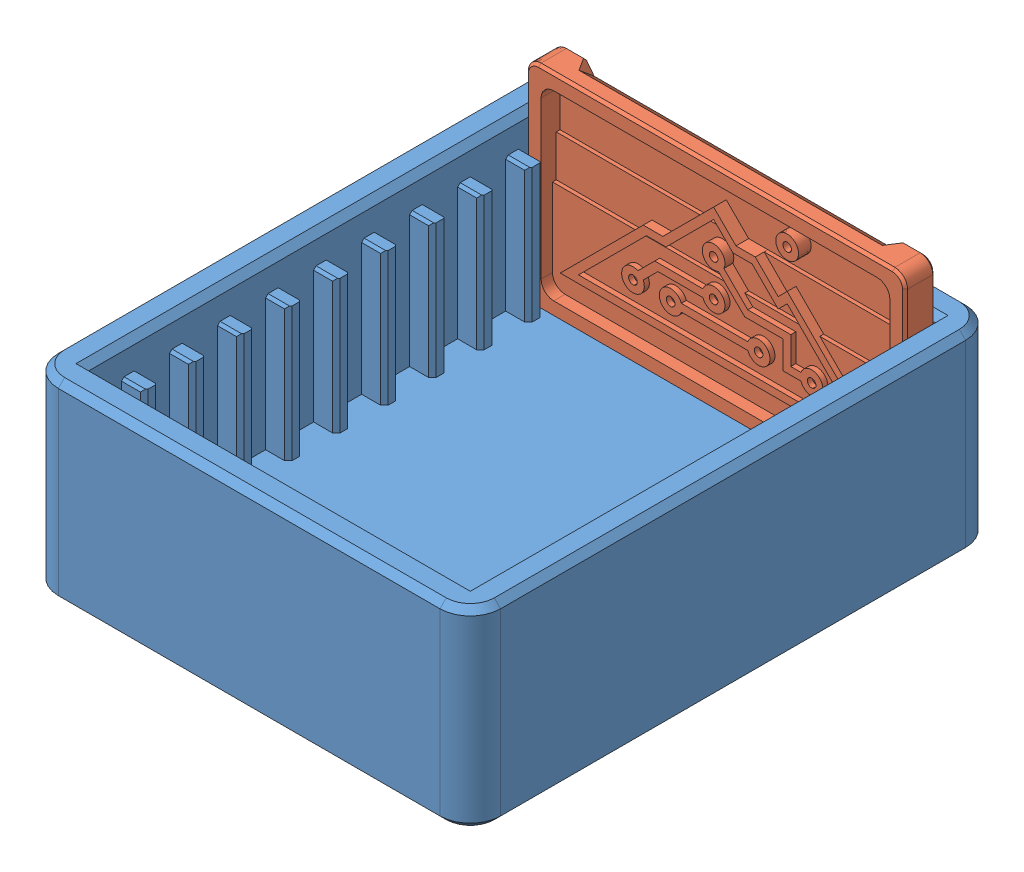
SolidWorks assembly Assembly filament tray.SLDASM, configuration Default (file format 12000). Lengths in mm.
Overall size (70 38.2 83.2).
2 component instances, 2 part files, 3 mates.
Components (placement in the parent):
- Annex filament card holder (10 pieces)-1: Annex filament card holder (10 pieces).SLDPRT [Default] at (-19.7283 20.0923 106.5088) size (70 30.4 83.2)
- Annex filament card-1: Annex filament card.SLDPRT [Default] at (-14.5283 24.6923 28.1088) size (60 33.6 4.8)
Mates (geometry in assembly coordinates):
- Coincident1: coincident anti-aligned: plane of Annex filament card holder (10 pieces)-1 through (-19.7283 50.4923 28.1088) normal (0 0 1); plane of Annex filament card-1 through (-14.5283 24.6923 28.1088) normal (0 0 -1)
- Coincident2: coincident anti-aligned: plane of Annex filament card holder (10 pieces)-1 through (45.4717 24.6923 106.5088) normal (-1 0 0); plane of Annex filament card-1 through (45.4717 24.6923 32.9088) normal (1 0 0)
- Coincident3: coincident anti-aligned: plane of Annex filament card holder (10 pieces)-1 through (-19.7283 24.6923 106.5088) normal (0 1 0); plane of Annex filament card-1 through (-14.5283 24.6923 32.9088) normal (0 -1 0)
